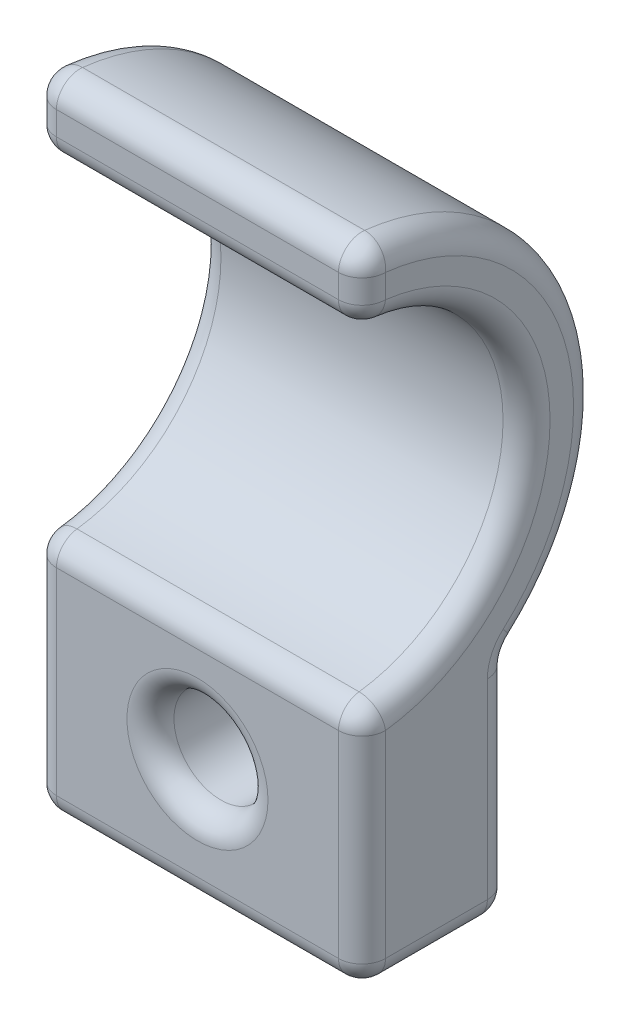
ISO-10303-21;
HEADER;
FILE_DESCRIPTION(('STEP AP214'),'2;1');
FILE_NAME('part.step','',(''),(''),'','','');
FILE_SCHEMA(('AUTOMOTIVE_DESIGN { 1 0 10303 214 1 1 1 1 }'));
ENDSEC;
DATA;
#1=APPLICATION_CONTEXT('core data for automotive mechanical design processes');
#2=APPLICATION_PROTOCOL_DEFINITION('international standard','automotive_design',2000,#1);
#3=PRODUCT_CONTEXT('',#1,'mechanical');
#4=PRODUCT('Part','Part','',(#3));
#5=PRODUCT_RELATED_PRODUCT_CATEGORY('part','',(#4));
#6=PRODUCT_DEFINITION_FORMATION('','',#4);
#7=PRODUCT_DEFINITION_CONTEXT('part definition',#1,'design');
#8=PRODUCT_DEFINITION('design','',#6,#7);
#9=PRODUCT_DEFINITION_SHAPE('','',#8);
#10=(LENGTH_UNIT() NAMED_UNIT(*) SI_UNIT(.MILLI.,.METRE.));
#11=(NAMED_UNIT(*) PLANE_ANGLE_UNIT() SI_UNIT($,.RADIAN.));
#12=(NAMED_UNIT(*) SI_UNIT($,.STERADIAN.) SOLID_ANGLE_UNIT());
#13=UNCERTAINTY_MEASURE_WITH_UNIT(LENGTH_MEASURE(1.E-05),#10,'distance_accuracy_value','');
#14=(GEOMETRIC_REPRESENTATION_CONTEXT(3) GLOBAL_UNCERTAINTY_ASSIGNED_CONTEXT((#13)) GLOBAL_UNIT_ASSIGNED_CONTEXT((#10,
#11,#12)) REPRESENTATION_CONTEXT('',''));
#15=CARTESIAN_POINT('',(0.,0.,0.));
#16=DIRECTION('',(0.,0.,1.));
#17=DIRECTION('',(1.,0.,0.));
#18=AXIS2_PLACEMENT_3D('',#15,#16,#17);
#19=CARTESIAN_POINT('',(-42.,0.,0.));
#20=DIRECTION('',(0.,0.,1.));
#21=DIRECTION('',(1.,0.,0.));
#22=AXIS2_PLACEMENT_3D('',#19,#20,#21);
#23=PLANE('',#22);
#24=DIRECTION('',(0.,-1.,0.));
#25=VECTOR('',#24,1.);
#26=CARTESIAN_POINT('',(-39.,0.,0.));
#27=LINE('',#26,#25);
#28=CARTESIAN_POINT('',(-39.,28.1882382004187,0.));
#29=VERTEX_POINT('',#28);
#30=CARTESIAN_POINT('',(-39.,3.,0.));
#31=VERTEX_POINT('',#30);
#32=EDGE_CURVE('E43',#29,#31,#27,.T.);
#33=ORIENTED_EDGE('',*,*,#32,.T.);
#34=DIRECTION('',(1.,0.,0.));
#35=VECTOR('',#34,1.);
#36=CARTESIAN_POINT('',(-42.,3.,0.));
#37=LINE('',#36,#35);
#38=CARTESIAN_POINT('',(-3.,3.,0.));
#39=VERTEX_POINT('',#38);
#40=EDGE_CURVE('E11',#31,#39,#37,.T.);
#41=ORIENTED_EDGE('',*,*,#40,.T.);
#42=DIRECTION('',(0.,-1.,0.));
#43=VECTOR('',#42,1.);
#44=CARTESIAN_POINT('',(-3.,0.,0.));
#45=LINE('',#44,#43);
#46=CARTESIAN_POINT('',(-3.,28.1882382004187,0.));
#47=VERTEX_POINT('',#46);
#48=EDGE_CURVE('E281',#39,#47,#45,.F.);
#49=ORIENTED_EDGE('',*,*,#48,.T.);
#50=DIRECTION('',(1.,0.,0.));
#51=VECTOR('',#50,1.);
#52=CARTESIAN_POINT('',(-42.,28.1882382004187,0.));
#53=LINE('',#52,#51);
#54=EDGE_CURVE('E54',#47,#29,#53,.F.);
#55=ORIENTED_EDGE('',*,*,#54,.T.);
#56=EDGE_LOOP('',(#33,#41,#49,#55));
#57=FACE_BOUND('',#56,.T.);
#58=CARTESIAN_POINT('',(-21.,16.,0.));
#59=DIRECTION('',(0.,0.,1.));
#60=DIRECTION('',(1.,0.,0.));
#61=AXIS2_PLACEMENT_3D('',#58,#59,#60);
#62=CIRCLE('',#61,9.);
#63=CARTESIAN_POINT('',(-12.,16.,0.));
#64=VERTEX_POINT('',#63);
#65=EDGE_CURVE('E278',#64,#64,#62,.F.);
#66=ORIENTED_EDGE('',*,*,#65,.T.);
#67=EDGE_LOOP('',(#66));
#68=FACE_BOUND('',#67,.T.);
#69=ADVANCED_FACE('F34',(#57,#68),#23,.T.);
#70=CARTESIAN_POINT('',(-42.,52.,0.));
#71=DIRECTION('',(1.,0.,0.));
#72=DIRECTION('',(0.,0.,-1.));
#73=AXIS2_PLACEMENT_3D('',#70,#71,#72);
#74=CYLINDRICAL_SURFACE('',#73,21.);
#75=CARTESIAN_POINT('',(-3.,52.,0.));
#76=DIRECTION('',(1.,0.,0.));
#77=DIRECTION('',(0.,0.,-1.));
#78=AXIS2_PLACEMENT_3D('',#75,#76,#77);
#79=CIRCLE('',#78,21.);
#80=CARTESIAN_POINT('',(-3.,31.1647084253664,-2.625));
#81=VERTEX_POINT('',#80);
#82=CARTESIAN_POINT('',(-3.,72.8352915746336,-2.625));
#83=VERTEX_POINT('',#82);
#84=EDGE_CURVE('E201',#81,#83,#79,.T.);
#85=ORIENTED_EDGE('',*,*,#84,.T.);
#86=DIRECTION('',(1.,0.,0.));
#87=VECTOR('',#86,1.);
#88=CARTESIAN_POINT('',(-42.,72.8352915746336,-2.625));
#89=LINE('',#88,#87);
#90=CARTESIAN_POINT('',(-39.,72.8352915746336,-2.625));
#91=VERTEX_POINT('',#90);
#92=EDGE_CURVE('E171',#83,#91,#89,.F.);
#93=ORIENTED_EDGE('',*,*,#92,.T.);
#94=CARTESIAN_POINT('',(-39.,52.,0.));
#95=DIRECTION('',(1.,0.,0.));
#96=DIRECTION('',(0.,0.,-1.));
#97=AXIS2_PLACEMENT_3D('',#94,#95,#96);
#98=CIRCLE('',#97,21.);
#99=CARTESIAN_POINT('',(-39.,31.1647084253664,-2.625));
#100=VERTEX_POINT('',#99);
#101=EDGE_CURVE('E207',#91,#100,#98,.F.);
#102=ORIENTED_EDGE('',*,*,#101,.T.);
#103=DIRECTION('',(1.,0.,0.));
#104=VECTOR('',#103,1.);
#105=CARTESIAN_POINT('',(-42.,31.1647084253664,-2.625));
#106=LINE('',#105,#104);
#107=EDGE_CURVE('E199',#100,#81,#106,.T.);
#108=ORIENTED_EDGE('',*,*,#107,.T.);
#109=EDGE_LOOP('',(#85,#93,#102,#108));
#110=FACE_BOUND('',#109,.T.);
#111=ADVANCED_FACE('F456',(#110),#74,.F.);
#112=CARTESIAN_POINT('',(-42.,73.,0.));
#113=DIRECTION('',(0.,0.,1.));
#114=DIRECTION('',(1.,0.,0.));
#115=AXIS2_PLACEMENT_3D('',#112,#113,#114);
#116=PLANE('',#115);
#117=DIRECTION('',(0.,-1.,0.));
#118=VECTOR('',#117,1.);
#119=CARTESIAN_POINT('',(-39.,73.,0.));
#120=LINE('',#119,#118);
#121=CARTESIAN_POINT('',(-39.,78.8328157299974,0.));
#122=VERTEX_POINT('',#121);
#123=CARTESIAN_POINT('',(-39.,75.8117617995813,0.));
#124=VERTEX_POINT('',#123);
#125=EDGE_CURVE('E197',#122,#124,#120,.T.);
#126=ORIENTED_EDGE('',*,*,#125,.T.);
#127=DIRECTION('',(1.,0.,0.));
#128=VECTOR('',#127,1.);
#129=CARTESIAN_POINT('',(-42.,75.8117617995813,0.));
#130=LINE('',#129,#128);
#131=CARTESIAN_POINT('',(-3.,75.8117617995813,0.));
#132=VERTEX_POINT('',#131);
#133=EDGE_CURVE('E169',#124,#132,#130,.T.);
#134=ORIENTED_EDGE('',*,*,#133,.T.);
#135=DIRECTION('',(0.,-1.,0.));
#136=VECTOR('',#135,1.);
#137=CARTESIAN_POINT('',(-3.,73.,0.));
#138=LINE('',#137,#136);
#139=CARTESIAN_POINT('',(-3.,78.8328157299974,0.));
#140=VERTEX_POINT('',#139);
#141=EDGE_CURVE('E187',#132,#140,#138,.F.);
#142=ORIENTED_EDGE('',*,*,#141,.T.);
#143=DIRECTION('',(1.,0.,0.));
#144=VECTOR('',#143,1.);
#145=CARTESIAN_POINT('',(-42.,78.8328157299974,0.));
#146=LINE('',#145,#144);
#147=EDGE_CURVE('E193',#140,#122,#146,.F.);
#148=ORIENTED_EDGE('',*,*,#147,.T.);
#149=EDGE_LOOP('',(#126,#134,#142,#148));
#150=FACE_BOUND('',#149,.T.);
#151=ADVANCED_FACE('F195',(#150),#116,.T.);
#152=CARTESIAN_POINT('',(-42.,52.,0.));
#153=DIRECTION('',(1.,0.,0.));
#154=DIRECTION('',(0.,0.,-1.));
#155=AXIS2_PLACEMENT_3D('',#152,#153,#154);
#156=CYLINDRICAL_SURFACE('',#155,30.);
#157=CARTESIAN_POINT('',(-39.,52.,0.));
#158=DIRECTION('',(1.,0.,0.));
#159=DIRECTION('',(0.,0.,-1.));
#160=AXIS2_PLACEMENT_3D('',#157,#158,#159);
#161=CIRCLE('',#160,30.);
#162=CARTESIAN_POINT('',(-39.,29.6393202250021,-20.));
#163=VERTEX_POINT('',#162);
#164=CARTESIAN_POINT('',(-39.,81.8142396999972,-3.33333333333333));
#165=VERTEX_POINT('',#164);
#166=EDGE_CURVE('E239',#163,#165,#161,.T.);
#167=ORIENTED_EDGE('',*,*,#166,.T.);
#168=DIRECTION('',(1.,0.,0.));
#169=VECTOR('',#168,1.);
#170=CARTESIAN_POINT('',(-42.,81.8142396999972,-3.33333333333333));
#171=LINE('',#170,#169);
#172=CARTESIAN_POINT('',(-3.,81.8142396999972,-3.33333333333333));
#173=VERTEX_POINT('',#172);
#174=EDGE_CURVE('E241',#165,#173,#171,.T.);
#175=ORIENTED_EDGE('',*,*,#174,.T.);
#176=CARTESIAN_POINT('',(-3.,52.,0.));
#177=DIRECTION('',(1.,0.,0.));
#178=DIRECTION('',(0.,0.,-1.));
#179=AXIS2_PLACEMENT_3D('',#176,#177,#178);
#180=CIRCLE('',#179,30.);
#181=CARTESIAN_POINT('',(-3.,29.6393202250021,-20.));
#182=VERTEX_POINT('',#181);
#183=EDGE_CURVE('E235',#173,#182,#180,.F.);
#184=ORIENTED_EDGE('',*,*,#183,.T.);
#185=DIRECTION('',(1.,0.,0.));
#186=VECTOR('',#185,1.);
#187=CARTESIAN_POINT('',(-42.,29.6393202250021,-20.));
#188=LINE('',#187,#186);
#189=EDGE_CURVE('E237',#182,#163,#188,.F.);
#190=ORIENTED_EDGE('',*,*,#189,.T.);
#191=EDGE_LOOP('',(#167,#175,#184,#190));
#192=FACE_BOUND('',#191,.T.);
#193=ADVANCED_FACE('F483',(#192),#156,.T.);
#194=CARTESIAN_POINT('',(-42.,0.,-19.));
#195=DIRECTION('',(0.,0.,-1.));
#196=DIRECTION('',(-1.,0.,0.));
#197=AXIS2_PLACEMENT_3D('',#194,#195,#196);
#198=PLANE('',#197);
#199=CARTESIAN_POINT('',(-21.,16.,-19.));
#200=DIRECTION('',(0.,0.,-1.));
#201=DIRECTION('',(-1.,0.,0.));
#202=AXIS2_PLACEMENT_3D('',#199,#200,#201);
#203=CIRCLE('',#202,9.);
#204=CARTESIAN_POINT('',(-30.,16.,-19.));
#205=VERTEX_POINT('',#204);
#206=EDGE_CURVE('E253',#205,#205,#203,.F.);
#207=ORIENTED_EDGE('',*,*,#206,.T.);
#208=EDGE_LOOP('',(#207));
#209=FACE_BOUND('',#208,.T.);
#210=DIRECTION('',(0.,1.,0.));
#211=VECTOR('',#210,1.);
#212=CARTESIAN_POINT('',(-39.,28.7836264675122,-19.));
#213=LINE('',#212,#211);
#214=CARTESIAN_POINT('',(-39.,3.,-19.));
#215=VERTEX_POINT('',#214);
#216=CARTESIAN_POINT('',(-39.,27.4032522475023,-19.));
#217=VERTEX_POINT('',#216);
#218=EDGE_CURVE('E248',#215,#217,#213,.T.);
#219=ORIENTED_EDGE('',*,*,#218,.T.);
#220=DIRECTION('',(-1.,0.,0.));
#221=VECTOR('',#220,1.);
#222=CARTESIAN_POINT('',(0.,27.4032522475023,-19.));
#223=LINE('',#222,#221);
#224=CARTESIAN_POINT('',(-3.,27.4032522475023,-19.));
#225=VERTEX_POINT('',#224);
#226=EDGE_CURVE('E250',#217,#225,#223,.F.);
#227=ORIENTED_EDGE('',*,*,#226,.T.);
#228=DIRECTION('',(0.,1.,0.));
#229=VECTOR('',#228,1.);
#230=CARTESIAN_POINT('',(-3.,0.,-19.));
#231=LINE('',#230,#229);
#232=CARTESIAN_POINT('',(-3.,3.,-19.));
#233=VERTEX_POINT('',#232);
#234=EDGE_CURVE('E244',#225,#233,#231,.F.);
#235=ORIENTED_EDGE('',*,*,#234,.T.);
#236=DIRECTION('',(1.,0.,0.));
#237=VECTOR('',#236,1.);
#238=CARTESIAN_POINT('',(-42.,3.,-19.));
#239=LINE('',#238,#237);
#240=EDGE_CURVE('E246',#233,#215,#239,.F.);
#241=ORIENTED_EDGE('',*,*,#240,.T.);
#242=EDGE_LOOP('',(#219,#227,#235,#241));
#243=FACE_BOUND('',#242,.T.);
#244=ADVANCED_FACE('F417',(#209,#243),#198,.T.);
#245=CARTESIAN_POINT('',(-42.,0.,0.));
#246=DIRECTION('',(0.,-1.,0.));
#247=DIRECTION('',(0.,0.,-1.));
#248=AXIS2_PLACEMENT_3D('',#245,#246,#247);
#249=PLANE('',#248);
#250=DIRECTION('',(1.,0.,0.));
#251=VECTOR('',#250,1.);
#252=CARTESIAN_POINT('',(-42.,0.,-3.));
#253=LINE('',#252,#251);
#254=CARTESIAN_POINT('',(-3.,0.,-3.));
#255=VERTEX_POINT('',#254);
#256=CARTESIAN_POINT('',(-39.,0.,-3.));
#257=VERTEX_POINT('',#256);
#258=EDGE_CURVE('E210',#255,#257,#253,.F.);
#259=ORIENTED_EDGE('',*,*,#258,.T.);
#260=DIRECTION('',(0.,0.,-1.));
#261=VECTOR('',#260,1.);
#262=CARTESIAN_POINT('',(-39.,0.,-19.));
#263=LINE('',#262,#261);
#264=CARTESIAN_POINT('',(-39.,0.,-16.));
#265=VERTEX_POINT('',#264);
#266=EDGE_CURVE('E216',#257,#265,#263,.T.);
#267=ORIENTED_EDGE('',*,*,#266,.T.);
#268=DIRECTION('',(1.,0.,0.));
#269=VECTOR('',#268,1.);
#270=CARTESIAN_POINT('',(-42.,0.,-16.));
#271=LINE('',#270,#269);
#272=CARTESIAN_POINT('',(-3.,0.,-16.));
#273=VERTEX_POINT('',#272);
#274=EDGE_CURVE('E214',#265,#273,#271,.T.);
#275=ORIENTED_EDGE('',*,*,#274,.T.);
#276=DIRECTION('',(0.,0.,-1.));
#277=VECTOR('',#276,1.);
#278=CARTESIAN_POINT('',(-3.,0.,0.));
#279=LINE('',#278,#277);
#280=EDGE_CURVE('E212',#273,#255,#279,.F.);
#281=ORIENTED_EDGE('',*,*,#280,.T.);
#282=EDGE_LOOP('',(#259,#267,#275,#281));
#283=FACE_BOUND('',#282,.T.);
#284=ADVANCED_FACE('F389',(#283),#249,.T.);
#285=CARTESIAN_POINT('',(-42.,52.,0.));
#286=DIRECTION('',(1.,0.,0.));
#287=DIRECTION('',(0.,0.,-1.));
#288=AXIS2_PLACEMENT_3D('',#285,#286,#287);
#289=PLANE('',#288);
#290=DIRECTION('',(0.,-1.,0.));
#291=VECTOR('',#290,1.);
#292=CARTESIAN_POINT('',(-42.,82.,-3.));
#293=LINE('',#292,#291);
#294=CARTESIAN_POINT('',(-42.,75.8117617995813,-3.));
#295=VERTEX_POINT('',#294);
#296=CARTESIAN_POINT('',(-42.,78.8328157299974,-3.));
#297=VERTEX_POINT('',#296);
#298=EDGE_CURVE('E223',#295,#297,#293,.F.);
#299=ORIENTED_EDGE('',*,*,#298,.T.);
#300=CARTESIAN_POINT('',(-42.,52.,0.));
#301=DIRECTION('',(1.,0.,0.));
#302=DIRECTION('',(0.,0.,-1.));
#303=AXIS2_PLACEMENT_3D('',#300,#301,#302);
#304=CIRCLE('',#303,27.);
#305=CARTESIAN_POINT('',(-42.,31.8753882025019,-18.));
#306=VERTEX_POINT('',#305);
#307=EDGE_CURVE('E233',#297,#306,#304,.F.);
#308=ORIENTED_EDGE('',*,*,#307,.T.);
#309=CARTESIAN_POINT('',(-42.,27.4032522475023,-22.));
#310=DIRECTION('',(1.,0.,0.));
#311=DIRECTION('',(0.,0.,-1.));
#312=AXIS2_PLACEMENT_3D('',#309,#310,#311);
#313=CIRCLE('',#312,6.);
#314=CARTESIAN_POINT('',(-42.,27.4032522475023,-16.));
#315=VERTEX_POINT('',#314);
#316=EDGE_CURVE('E230',#315,#306,#313,.F.);
#317=ORIENTED_EDGE('',*,*,#316,.F.);
#318=DIRECTION('',(0.,1.,0.));
#319=VECTOR('',#318,1.);
#320=CARTESIAN_POINT('',(-42.,0.,-16.));
#321=LINE('',#320,#319);
#322=CARTESIAN_POINT('',(-42.,3.,-16.));
#323=VERTEX_POINT('',#322);
#324=EDGE_CURVE('E228',#315,#323,#321,.F.);
#325=ORIENTED_EDGE('',*,*,#324,.T.);
#326=DIRECTION('',(0.,0.,-1.));
#327=VECTOR('',#326,1.);
#328=CARTESIAN_POINT('',(-42.,3.,0.));
#329=LINE('',#328,#327);
#330=CARTESIAN_POINT('',(-42.,3.,-3.));
#331=VERTEX_POINT('',#330);
#332=EDGE_CURVE('E225',#323,#331,#329,.F.);
#333=ORIENTED_EDGE('',*,*,#332,.T.);
#334=DIRECTION('',(0.,-1.,0.));
#335=VECTOR('',#334,1.);
#336=CARTESIAN_POINT('',(-42.,31.,-3.));
#337=LINE('',#336,#335);
#338=CARTESIAN_POINT('',(-42.,28.1882382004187,-3.));
#339=VERTEX_POINT('',#338);
#340=EDGE_CURVE('E219',#331,#339,#337,.F.);
#341=ORIENTED_EDGE('',*,*,#340,.T.);
#342=CARTESIAN_POINT('',(-42.,52.,0.));
#343=DIRECTION('',(1.,0.,0.));
#344=DIRECTION('',(0.,0.,-1.));
#345=AXIS2_PLACEMENT_3D('',#342,#343,#344);
#346=CIRCLE('',#345,24.);
#347=EDGE_CURVE('E221',#339,#295,#346,.T.);
#348=ORIENTED_EDGE('',*,*,#347,.T.);
#349=EDGE_LOOP('',(#299,#308,#317,#325,#333,#341,#348));
#350=FACE_BOUND('',#349,.T.);
#351=ADVANCED_FACE('F408',(#350),#289,.F.);
#352=CARTESIAN_POINT('',(0.,52.,0.));
#353=DIRECTION('',(1.,0.,0.));
#354=DIRECTION('',(0.,0.,-1.));
#355=AXIS2_PLACEMENT_3D('',#352,#353,#354);
#356=PLANE('',#355);
#357=CARTESIAN_POINT('',(0.,52.,0.));
#358=DIRECTION('',(1.,0.,0.));
#359=DIRECTION('',(0.,0.,-1.));
#360=AXIS2_PLACEMENT_3D('',#357,#358,#359);
#361=CIRCLE('',#360,27.);
#362=CARTESIAN_POINT('',(0.,31.8753882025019,-18.));
#363=VERTEX_POINT('',#362);
#364=CARTESIAN_POINT('',(0.,78.8328157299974,-3.));
#365=VERTEX_POINT('',#364);
#366=EDGE_CURVE('E274',#363,#365,#361,.T.);
#367=ORIENTED_EDGE('',*,*,#366,.T.);
#368=DIRECTION('',(0.,-1.,0.));
#369=VECTOR('',#368,1.);
#370=CARTESIAN_POINT('',(0.,52.,-3.));
#371=LINE('',#370,#369);
#372=CARTESIAN_POINT('',(0.,75.8117617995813,-3.));
#373=VERTEX_POINT('',#372);
#374=EDGE_CURVE('E276',#365,#373,#371,.T.);
#375=ORIENTED_EDGE('',*,*,#374,.T.);
#376=CARTESIAN_POINT('',(0.,52.,0.));
#377=DIRECTION('',(1.,0.,0.));
#378=DIRECTION('',(0.,0.,-1.));
#379=AXIS2_PLACEMENT_3D('',#376,#377,#378);
#380=CIRCLE('',#379,24.);
#381=CARTESIAN_POINT('',(0.,28.1882382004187,-3.));
#382=VERTEX_POINT('',#381);
#383=EDGE_CURVE('E268',#373,#382,#380,.F.);
#384=ORIENTED_EDGE('',*,*,#383,.T.);
#385=DIRECTION('',(0.,-1.,0.));
#386=VECTOR('',#385,1.);
#387=CARTESIAN_POINT('',(0.,52.,-3.));
#388=LINE('',#387,#386);
#389=CARTESIAN_POINT('',(0.,3.,-3.));
#390=VERTEX_POINT('',#389);
#391=EDGE_CURVE('E262',#382,#390,#388,.T.);
#392=ORIENTED_EDGE('',*,*,#391,.T.);
#393=DIRECTION('',(0.,0.,-1.));
#394=VECTOR('',#393,1.);
#395=CARTESIAN_POINT('',(0.,3.,0.));
#396=LINE('',#395,#394);
#397=CARTESIAN_POINT('',(0.,3.,-16.));
#398=VERTEX_POINT('',#397);
#399=EDGE_CURVE('E264',#390,#398,#396,.T.);
#400=ORIENTED_EDGE('',*,*,#399,.T.);
#401=DIRECTION('',(0.,1.,0.));
#402=VECTOR('',#401,1.);
#403=CARTESIAN_POINT('',(0.,52.,-16.));
#404=LINE('',#403,#402);
#405=CARTESIAN_POINT('',(0.,27.4032522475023,-16.));
#406=VERTEX_POINT('',#405);
#407=EDGE_CURVE('E266',#398,#406,#404,.T.);
#408=ORIENTED_EDGE('',*,*,#407,.T.);
#409=CARTESIAN_POINT('',(0.,27.4032522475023,-22.));
#410=DIRECTION('',(1.,0.,0.));
#411=DIRECTION('',(0.,0.,-1.));
#412=AXIS2_PLACEMENT_3D('',#409,#410,#411);
#413=CIRCLE('',#412,6.);
#414=EDGE_CURVE('E271',#363,#406,#413,.T.);
#415=ORIENTED_EDGE('',*,*,#414,.F.);
#416=EDGE_LOOP('',(#367,#375,#384,#392,#400,#408,#415));
#417=FACE_BOUND('',#416,.T.);
#418=ADVANCED_FACE('F490',(#417),#356,.T.);
#419=CARTESIAN_POINT('',(-21.,16.,-30.));
#420=DIRECTION('',(0.,0.,1.));
#421=DIRECTION('',(1.,0.,0.));
#422=AXIS2_PLACEMENT_3D('',#419,#420,#421);
#423=CYLINDRICAL_SURFACE('',#422,6.);
#424=CARTESIAN_POINT('',(-21.,16.,-16.));
#425=DIRECTION('',(0.,0.,-1.));
#426=DIRECTION('',(-1.,0.,0.));
#427=AXIS2_PLACEMENT_3D('',#424,#425,#426);
#428=CIRCLE('',#427,6.);
#429=CARTESIAN_POINT('',(-27.,16.,-16.));
#430=VERTEX_POINT('',#429);
#431=EDGE_CURVE('E259',#430,#430,#428,.T.);
#432=ORIENTED_EDGE('',*,*,#431,.T.);
#433=EDGE_LOOP('',(#432));
#434=FACE_BOUND('',#433,.T.);
#435=CARTESIAN_POINT('',(-21.,16.,-3.));
#436=DIRECTION('',(0.,0.,1.));
#437=DIRECTION('',(1.,0.,0.));
#438=AXIS2_PLACEMENT_3D('',#435,#436,#437);
#439=CIRCLE('',#438,6.);
#440=CARTESIAN_POINT('',(-15.,16.,-3.));
#441=VERTEX_POINT('',#440);
#442=EDGE_CURVE('E256',#441,#441,#439,.T.);
#443=ORIENTED_EDGE('',*,*,#442,.T.);
#444=EDGE_LOOP('',(#443));
#445=FACE_BOUND('',#444,.T.);
#446=ADVANCED_FACE('F492',(#434,#445),#423,.F.);
#447=CARTESIAN_POINT('',(-42.,3.,-16.));
#448=DIRECTION('',(1.,0.,0.));
#449=DIRECTION('',(0.,0.,-1.));
#450=AXIS2_PLACEMENT_3D('',#447,#448,#449);
#451=CYLINDRICAL_SURFACE('',#450,3.);
#452=CARTESIAN_POINT('',(-39.,3.,-16.));
#453=DIRECTION('',(-1.,0.,0.));
#454=DIRECTION('',(0.,0.,1.));
#455=AXIS2_PLACEMENT_3D('',#452,#453,#454);
#456=CIRCLE('',#455,3.);
#457=EDGE_CURVE('E38',#215,#265,#456,.T.);
#458=ORIENTED_EDGE('',*,*,#457,.F.);
#459=ORIENTED_EDGE('',*,*,#240,.F.);
#460=CARTESIAN_POINT('',(-3.,3.,-16.));
#461=DIRECTION('',(1.,0.,0.));
#462=DIRECTION('',(0.,0.,-1.));
#463=AXIS2_PLACEMENT_3D('',#460,#461,#462);
#464=CIRCLE('',#463,3.);
#465=EDGE_CURVE('E369',#273,#233,#464,.T.);
#466=ORIENTED_EDGE('',*,*,#465,.F.);
#467=ORIENTED_EDGE('',*,*,#274,.F.);
#468=EDGE_LOOP('',(#458,#459,#466,#467));
#469=FACE_BOUND('',#468,.T.);
#470=ADVANCED_FACE('F386',(#469),#451,.T.);
#471=CARTESIAN_POINT('',(-39.,3.,-16.));
#472=DIRECTION('',(0.,0.,1.));
#473=DIRECTION('',(1.,0.,0.));
#474=AXIS2_PLACEMENT_3D('',#471,#472,#473);
#475=SPHERICAL_SURFACE('',#474,3.);
#476=CARTESIAN_POINT('',(-39.,3.,-16.));
#477=DIRECTION('',(0.,-1.,0.));
#478=DIRECTION('',(0.,0.,-1.));
#479=AXIS2_PLACEMENT_3D('',#476,#477,#478);
#480=CIRCLE('',#479,3.);
#481=EDGE_CURVE('E365',#215,#323,#480,.F.);
#482=ORIENTED_EDGE('',*,*,#481,.F.);
#483=ORIENTED_EDGE('',*,*,#457,.T.);
#484=CARTESIAN_POINT('',(-39.,3.,-16.));
#485=DIRECTION('',(0.,0.,-1.));
#486=DIRECTION('',(-1.,0.,0.));
#487=AXIS2_PLACEMENT_3D('',#484,#485,#486);
#488=CIRCLE('',#487,3.);
#489=EDGE_CURVE('E368',#323,#265,#488,.F.);
#490=ORIENTED_EDGE('',*,*,#489,.F.);
#491=EDGE_LOOP('',(#482,#483,#490));
#492=FACE_BOUND('',#491,.T.);
#493=ADVANCED_FACE('F381',(#492),#475,.T.);
#494=CARTESIAN_POINT('',(-3.,3.,-16.));
#495=DIRECTION('',(0.,0.,1.));
#496=DIRECTION('',(1.,0.,0.));
#497=AXIS2_PLACEMENT_3D('',#494,#495,#496);
#498=SPHERICAL_SURFACE('',#497,3.);
#499=CARTESIAN_POINT('',(-3.,3.,-16.));
#500=DIRECTION('',(0.,0.,-1.));
#501=DIRECTION('',(-1.,0.,0.));
#502=AXIS2_PLACEMENT_3D('',#499,#500,#501);
#503=CIRCLE('',#502,3.);
#504=EDGE_CURVE('E359',#273,#398,#503,.F.);
#505=ORIENTED_EDGE('',*,*,#504,.F.);
#506=ORIENTED_EDGE('',*,*,#465,.T.);
#507=CARTESIAN_POINT('',(-3.,3.,-16.));
#508=DIRECTION('',(0.,-1.,0.));
#509=DIRECTION('',(1.,0.,0.));
#510=AXIS2_PLACEMENT_3D('',#507,#508,#509);
#511=CIRCLE('',#510,3.);
#512=EDGE_CURVE('E362',#398,#233,#511,.F.);
#513=ORIENTED_EDGE('',*,*,#512,.F.);
#514=EDGE_LOOP('',(#505,#506,#513));
#515=FACE_BOUND('',#514,.T.);
#516=ADVANCED_FACE('F431',(#515),#498,.T.);
#517=CARTESIAN_POINT('',(-39.,3.,0.));
#518=DIRECTION('',(0.,0.,1.));
#519=DIRECTION('',(1.,0.,0.));
#520=AXIS2_PLACEMENT_3D('',#517,#518,#519);
#521=CYLINDRICAL_SURFACE('',#520,3.);
#522=ORIENTED_EDGE('',*,*,#489,.T.);
#523=ORIENTED_EDGE('',*,*,#266,.F.);
#524=CARTESIAN_POINT('',(-39.,3.,-3.));
#525=DIRECTION('',(0.,0.,1.));
#526=DIRECTION('',(1.,0.,0.));
#527=AXIS2_PLACEMENT_3D('',#524,#525,#526);
#528=CIRCLE('',#527,3.);
#529=EDGE_CURVE('E353',#331,#257,#528,.T.);
#530=ORIENTED_EDGE('',*,*,#529,.F.);
#531=ORIENTED_EDGE('',*,*,#332,.F.);
#532=EDGE_LOOP('',(#522,#523,#530,#531));
#533=FACE_BOUND('',#532,.T.);
#534=ADVANCED_FACE('F394',(#533),#521,.T.);
#535=CARTESIAN_POINT('',(-39.,0.,-16.));
#536=DIRECTION('',(0.,-1.,0.));
#537=DIRECTION('',(0.,0.,-1.));
#538=AXIS2_PLACEMENT_3D('',#535,#536,#537);
#539=CYLINDRICAL_SURFACE('',#538,3.);
#540=ORIENTED_EDGE('',*,*,#481,.T.);
#541=ORIENTED_EDGE('',*,*,#324,.F.);
#542=CARTESIAN_POINT('',(-39.,27.4032522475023,-16.));
#543=DIRECTION('',(0.,1.,0.));
#544=DIRECTION('',(0.,0.,1.));
#545=AXIS2_PLACEMENT_3D('',#542,#543,#544);
#546=CIRCLE('',#545,3.);
#547=EDGE_CURVE('E350',#217,#315,#546,.T.);
#548=ORIENTED_EDGE('',*,*,#547,.F.);
#549=ORIENTED_EDGE('',*,*,#218,.F.);
#550=EDGE_LOOP('',(#540,#541,#548,#549));
#551=FACE_BOUND('',#550,.T.);
#552=ADVANCED_FACE('F414',(#551),#539,.T.);
#553=CARTESIAN_POINT('',(-42.,27.4032522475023,-22.));
#554=DIRECTION('',(1.,0.,0.));
#555=DIRECTION('',(0.,0.,-1.));
#556=AXIS2_PLACEMENT_3D('',#553,#554,#555);
#557=CYLINDRICAL_SURFACE('',#556,3.);
#558=CARTESIAN_POINT('',(-3.00000000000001,27.4032522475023,-22.));
#559=DIRECTION('',(1.,0.,0.));
#560=DIRECTION('',(0.,0.,-1.));
#561=AXIS2_PLACEMENT_3D('',#558,#559,#560);
#562=CIRCLE('',#561,3.);
#563=EDGE_CURVE('E344',#225,#182,#562,.F.);
#564=ORIENTED_EDGE('',*,*,#563,.F.);
#565=ORIENTED_EDGE('',*,*,#226,.F.);
#566=CARTESIAN_POINT('',(-39.,27.4032522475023,-22.));
#567=DIRECTION('',(1.,0.,0.));
#568=DIRECTION('',(0.,0.,-1.));
#569=AXIS2_PLACEMENT_3D('',#566,#567,#568);
#570=CIRCLE('',#569,3.);
#571=EDGE_CURVE('E347',#163,#217,#570,.T.);
#572=ORIENTED_EDGE('',*,*,#571,.F.);
#573=ORIENTED_EDGE('',*,*,#189,.F.);
#574=EDGE_LOOP('',(#564,#565,#572,#573));
#575=FACE_BOUND('',#574,.T.);
#576=ADVANCED_FACE('F421',(#575),#557,.F.);
#577=CARTESIAN_POINT('',(-3.,52.,-16.));
#578=DIRECTION('',(0.,1.,0.));
#579=DIRECTION('',(0.,0.,1.));
#580=AXIS2_PLACEMENT_3D('',#577,#578,#579);
#581=CYLINDRICAL_SURFACE('',#580,3.);
#582=ORIENTED_EDGE('',*,*,#512,.T.);
#583=ORIENTED_EDGE('',*,*,#234,.F.);
#584=CARTESIAN_POINT('',(-3.,27.4032522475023,-16.));
#585=DIRECTION('',(0.,1.,0.));
#586=DIRECTION('',(0.,0.,1.));
#587=AXIS2_PLACEMENT_3D('',#584,#585,#586);
#588=CIRCLE('',#587,3.);
#589=EDGE_CURVE('E342',#406,#225,#588,.T.);
#590=ORIENTED_EDGE('',*,*,#589,.F.);
#591=ORIENTED_EDGE('',*,*,#407,.F.);
#592=EDGE_LOOP('',(#582,#583,#590,#591));
#593=FACE_BOUND('',#592,.T.);
#594=ADVANCED_FACE('F429',(#593),#581,.T.);
#595=CARTESIAN_POINT('',(-3.,3.,0.));
#596=DIRECTION('',(0.,0.,-1.));
#597=DIRECTION('',(-1.,0.,0.));
#598=AXIS2_PLACEMENT_3D('',#595,#596,#597);
#599=CYLINDRICAL_SURFACE('',#598,3.);
#600=ORIENTED_EDGE('',*,*,#504,.T.);
#601=ORIENTED_EDGE('',*,*,#399,.F.);
#602=CARTESIAN_POINT('',(-3.,3.,-3.));
#603=DIRECTION('',(0.,0.,1.));
#604=DIRECTION('',(1.,0.,0.));
#605=AXIS2_PLACEMENT_3D('',#602,#603,#604);
#606=CIRCLE('',#605,3.);
#607=EDGE_CURVE('E339',#255,#390,#606,.T.);
#608=ORIENTED_EDGE('',*,*,#607,.F.);
#609=ORIENTED_EDGE('',*,*,#280,.F.);
#610=EDGE_LOOP('',(#600,#601,#608,#609));
#611=FACE_BOUND('',#610,.T.);
#612=ADVANCED_FACE('F435',(#611),#599,.T.);
#613=CARTESIAN_POINT('',(-42.,3.,-3.));
#614=DIRECTION('',(1.,0.,0.));
#615=DIRECTION('',(0.,0.,-1.));
#616=AXIS2_PLACEMENT_3D('',#613,#614,#615);
#617=CYLINDRICAL_SURFACE('',#616,3.);
#618=CARTESIAN_POINT('',(-39.,3.,-3.));
#619=DIRECTION('',(-1.,0.,0.));
#620=DIRECTION('',(0.,0.,1.));
#621=AXIS2_PLACEMENT_3D('',#618,#619,#620);
#622=CIRCLE('',#621,3.);
#623=EDGE_CURVE('E356',#257,#31,#622,.T.);
#624=ORIENTED_EDGE('',*,*,#623,.F.);
#625=ORIENTED_EDGE('',*,*,#258,.F.);
#626=CARTESIAN_POINT('',(-3.,3.,-3.));
#627=DIRECTION('',(1.,0.,0.));
#628=DIRECTION('',(0.,0.,-1.));
#629=AXIS2_PLACEMENT_3D('',#626,#627,#628);
#630=CIRCLE('',#629,3.);
#631=EDGE_CURVE('E336',#39,#255,#630,.T.);
#632=ORIENTED_EDGE('',*,*,#631,.F.);
#633=ORIENTED_EDGE('',*,*,#40,.F.);
#634=EDGE_LOOP('',(#624,#625,#632,#633));
#635=FACE_BOUND('',#634,.T.);
#636=ADVANCED_FACE('F396',(#635),#617,.T.);
#637=CARTESIAN_POINT('',(-39.,3.,-3.));
#638=DIRECTION('',(0.,0.,1.));
#639=DIRECTION('',(1.,0.,0.));
#640=AXIS2_PLACEMENT_3D('',#637,#638,#639);
#641=SPHERICAL_SURFACE('',#640,3.);
#642=ORIENTED_EDGE('',*,*,#529,.T.);
#643=ORIENTED_EDGE('',*,*,#623,.T.);
#644=CARTESIAN_POINT('',(-39.,3.,-3.));
#645=DIRECTION('',(0.,-1.,0.));
#646=DIRECTION('',(0.,0.,-1.));
#647=AXIS2_PLACEMENT_3D('',#644,#645,#646);
#648=CIRCLE('',#647,3.);
#649=EDGE_CURVE('E333',#331,#31,#648,.F.);
#650=ORIENTED_EDGE('',*,*,#649,.F.);
#651=EDGE_LOOP('',(#642,#643,#650));
#652=FACE_BOUND('',#651,.T.);
#653=ADVANCED_FACE('F401',(#652),#641,.T.);
#654=CARTESIAN_POINT('',(-39.,27.4032522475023,-22.));
#655=DIRECTION('',(1.,0.,0.));
#656=DIRECTION('',(0.,0.,-1.));
#657=AXIS2_PLACEMENT_3D('',#654,#655,#656);
#658=TOROIDAL_SURFACE('',#657,6.,3.);
#659=ORIENTED_EDGE('',*,*,#547,.T.);
#660=ORIENTED_EDGE('',*,*,#316,.T.);
#661=CARTESIAN_POINT('',(-39.,31.8753882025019,-18.));
#662=DIRECTION('',(0.,-0.666666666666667,0.745355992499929));
#663=DIRECTION('',(0.,-0.745355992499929,-0.666666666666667));
#664=AXIS2_PLACEMENT_3D('',#661,#662,#663);
#665=CIRCLE('',#664,3.);
#666=EDGE_CURVE('E330',#163,#306,#665,.F.);
#667=ORIENTED_EDGE('',*,*,#666,.F.);
#668=ORIENTED_EDGE('',*,*,#571,.T.);
#669=EDGE_LOOP('',(#659,#660,#667,#668));
#670=FACE_BOUND('',#669,.T.);
#671=ADVANCED_FACE('F551',(#670),#658,.T.);
#672=CARTESIAN_POINT('',(-3.,27.4032522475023,-22.));
#673=DIRECTION('',(1.,0.,0.));
#674=DIRECTION('',(0.,0.,-1.));
#675=AXIS2_PLACEMENT_3D('',#672,#673,#674);
#676=TOROIDAL_SURFACE('',#675,6.,3.);
#677=ORIENTED_EDGE('',*,*,#589,.T.);
#678=ORIENTED_EDGE('',*,*,#563,.T.);
#679=CARTESIAN_POINT('',(-3.,31.8753882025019,-18.));
#680=DIRECTION('',(0.,-0.666666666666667,0.745355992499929));
#681=DIRECTION('',(0.,-0.745355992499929,-0.666666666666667));
#682=AXIS2_PLACEMENT_3D('',#679,#680,#681);
#683=CIRCLE('',#682,3.);
#684=EDGE_CURVE('E327',#363,#182,#683,.F.);
#685=ORIENTED_EDGE('',*,*,#684,.F.);
#686=ORIENTED_EDGE('',*,*,#414,.T.);
#687=EDGE_LOOP('',(#677,#678,#685,#686));
#688=FACE_BOUND('',#687,.T.);
#689=ADVANCED_FACE('F488',(#688),#676,.T.);
#690=CARTESIAN_POINT('',(-3.,3.,-3.));
#691=DIRECTION('',(0.,0.,1.));
#692=DIRECTION('',(1.,0.,0.));
#693=AXIS2_PLACEMENT_3D('',#690,#691,#692);
#694=SPHERICAL_SURFACE('',#693,3.);
#695=ORIENTED_EDGE('',*,*,#631,.T.);
#696=ORIENTED_EDGE('',*,*,#607,.T.);
#697=CARTESIAN_POINT('',(-3.,3.,-3.));
#698=DIRECTION('',(0.,-1.,0.));
#699=DIRECTION('',(0.,0.,-1.));
#700=AXIS2_PLACEMENT_3D('',#697,#698,#699);
#701=CIRCLE('',#700,3.);
#702=EDGE_CURVE('E324',#39,#390,#701,.F.);
#703=ORIENTED_EDGE('',*,*,#702,.F.);
#704=EDGE_LOOP('',(#695,#696,#703));
#705=FACE_BOUND('',#704,.T.);
#706=ADVANCED_FACE('F438',(#705),#694,.T.);
#707=CARTESIAN_POINT('',(-39.,0.,-3.));
#708=DIRECTION('',(0.,1.,0.));
#709=DIRECTION('',(0.,0.,1.));
#710=AXIS2_PLACEMENT_3D('',#707,#708,#709);
#711=CYLINDRICAL_SURFACE('',#710,3.);
#712=ORIENTED_EDGE('',*,*,#649,.T.);
#713=ORIENTED_EDGE('',*,*,#32,.F.);
#714=CARTESIAN_POINT('',(-39.,28.1882382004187,-3.));
#715=DIRECTION('',(0.,1.,0.));
#716=DIRECTION('',(0.,0.,1.));
#717=AXIS2_PLACEMENT_3D('',#714,#715,#716);
#718=CIRCLE('',#717,3.);
#719=EDGE_CURVE('E318',#339,#29,#718,.T.);
#720=ORIENTED_EDGE('',*,*,#719,.F.);
#721=ORIENTED_EDGE('',*,*,#340,.F.);
#722=EDGE_LOOP('',(#712,#713,#720,#721));
#723=FACE_BOUND('',#722,.T.);
#724=ADVANCED_FACE('F403',(#723),#711,.T.);
#725=CARTESIAN_POINT('',(-39.,52.,0.));
#726=DIRECTION('',(1.,0.,0.));
#727=DIRECTION('',(0.,0.,-1.));
#728=AXIS2_PLACEMENT_3D('',#725,#726,#727);
#729=TOROIDAL_SURFACE('',#728,27.,3.);
#730=ORIENTED_EDGE('',*,*,#666,.T.);
#731=ORIENTED_EDGE('',*,*,#307,.F.);
#732=CARTESIAN_POINT('',(-39.,78.8328157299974,-3.));
#733=DIRECTION('',(0.,0.111111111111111,0.993807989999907));
#734=DIRECTION('',(0.,-0.993807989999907,0.111111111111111));
#735=AXIS2_PLACEMENT_3D('',#732,#733,#734);
#736=CIRCLE('',#735,3.);
#737=EDGE_CURVE('E315',#165,#297,#736,.T.);
#738=ORIENTED_EDGE('',*,*,#737,.F.);
#739=ORIENTED_EDGE('',*,*,#166,.F.);
#740=EDGE_LOOP('',(#730,#731,#738,#739));
#741=FACE_BOUND('',#740,.T.);
#742=ADVANCED_FACE('F472',(#741),#729,.T.);
#743=CARTESIAN_POINT('',(-42.,78.8328157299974,-3.));
#744=DIRECTION('',(1.,0.,0.));
#745=DIRECTION('',(0.,0.,-1.));
#746=AXIS2_PLACEMENT_3D('',#743,#744,#745);
#747=CYLINDRICAL_SURFACE('',#746,3.);
#748=CARTESIAN_POINT('',(-3.,78.8328157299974,-3.));
#749=DIRECTION('',(1.,0.,0.));
#750=DIRECTION('',(0.,0.,-1.));
#751=AXIS2_PLACEMENT_3D('',#748,#749,#750);
#752=CIRCLE('',#751,3.);
#753=EDGE_CURVE('E309',#173,#140,#752,.T.);
#754=ORIENTED_EDGE('',*,*,#753,.F.);
#755=ORIENTED_EDGE('',*,*,#174,.F.);
#756=CARTESIAN_POINT('',(-39.,78.8328157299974,-3.));
#757=DIRECTION('',(-1.,0.,0.));
#758=DIRECTION('',(0.,0.,1.));
#759=AXIS2_PLACEMENT_3D('',#756,#757,#758);
#760=CIRCLE('',#759,3.);
#761=EDGE_CURVE('E312',#122,#165,#760,.T.);
#762=ORIENTED_EDGE('',*,*,#761,.F.);
#763=ORIENTED_EDGE('',*,*,#147,.F.);
#764=EDGE_LOOP('',(#754,#755,#762,#763));
#765=FACE_BOUND('',#764,.T.);
#766=ADVANCED_FACE('F480',(#765),#747,.T.);
#767=CARTESIAN_POINT('',(-3.,52.,0.));
#768=DIRECTION('',(1.,0.,0.));
#769=DIRECTION('',(0.,0.,-1.));
#770=AXIS2_PLACEMENT_3D('',#767,#768,#769);
#771=TOROIDAL_SURFACE('',#770,27.,3.);
#772=ORIENTED_EDGE('',*,*,#684,.T.);
#773=ORIENTED_EDGE('',*,*,#183,.F.);
#774=CARTESIAN_POINT('',(-3.,78.8328157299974,-3.));
#775=DIRECTION('',(0.,0.111111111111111,0.993807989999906));
#776=DIRECTION('',(0.,-0.993807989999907,0.111111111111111));
#777=AXIS2_PLACEMENT_3D('',#774,#775,#776);
#778=CIRCLE('',#777,3.);
#779=EDGE_CURVE('E307',#365,#173,#778,.T.);
#780=ORIENTED_EDGE('',*,*,#779,.F.);
#781=ORIENTED_EDGE('',*,*,#366,.F.);
#782=EDGE_LOOP('',(#772,#773,#780,#781));
#783=FACE_BOUND('',#782,.T.);
#784=ADVANCED_FACE('F486',(#783),#771,.T.);
#785=CARTESIAN_POINT('',(-3.,52.,-3.));
#786=DIRECTION('',(0.,-1.,0.));
#787=DIRECTION('',(0.,0.,-1.));
#788=AXIS2_PLACEMENT_3D('',#785,#786,#787);
#789=CYLINDRICAL_SURFACE('',#788,3.);
#790=ORIENTED_EDGE('',*,*,#702,.T.);
#791=ORIENTED_EDGE('',*,*,#391,.F.);
#792=CARTESIAN_POINT('',(-3.,28.1882382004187,-3.));
#793=DIRECTION('',(0.,1.,0.));
#794=DIRECTION('',(-1.,0.,0.));
#795=AXIS2_PLACEMENT_3D('',#792,#793,#794);
#796=CIRCLE('',#795,3.);
#797=EDGE_CURVE('E304',#47,#382,#796,.T.);
#798=ORIENTED_EDGE('',*,*,#797,.F.);
#799=ORIENTED_EDGE('',*,*,#48,.F.);
#800=EDGE_LOOP('',(#790,#791,#798,#799));
#801=FACE_BOUND('',#800,.T.);
#802=ADVANCED_FACE('F448',(#801),#789,.T.);
#803=CARTESIAN_POINT('',(-42.,28.1882382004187,-3.));
#804=DIRECTION('',(1.,0.,0.));
#805=DIRECTION('',(0.,0.,-1.));
#806=AXIS2_PLACEMENT_3D('',#803,#804,#805);
#807=CYLINDRICAL_SURFACE('',#806,3.);
#808=CARTESIAN_POINT('',(-39.,28.1882382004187,-3.));
#809=DIRECTION('',(-1.,0.,0.));
#810=DIRECTION('',(0.,0.,1.));
#811=AXIS2_PLACEMENT_3D('',#808,#809,#810);
#812=CIRCLE('',#811,3.);
#813=EDGE_CURVE('E321',#29,#100,#812,.T.);
#814=ORIENTED_EDGE('',*,*,#813,.F.);
#815=ORIENTED_EDGE('',*,*,#54,.F.);
#816=CARTESIAN_POINT('',(-3.,28.1882382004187,-3.));
#817=DIRECTION('',(1.,0.,0.));
#818=DIRECTION('',(0.,1.,0.));
#819=AXIS2_PLACEMENT_3D('',#816,#817,#818);
#820=CIRCLE('',#819,3.);
#821=EDGE_CURVE('E301',#81,#47,#820,.T.);
#822=ORIENTED_EDGE('',*,*,#821,.F.);
#823=ORIENTED_EDGE('',*,*,#107,.F.);
#824=EDGE_LOOP('',(#814,#815,#822,#823));
#825=FACE_BOUND('',#824,.T.);
#826=ADVANCED_FACE('F444',(#825),#807,.T.);
#827=CARTESIAN_POINT('',(-39.,28.1882382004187,-3.));
#828=DIRECTION('',(0.,0.,1.));
#829=DIRECTION('',(1.,0.,0.));
#830=AXIS2_PLACEMENT_3D('',#827,#828,#829);
#831=SPHERICAL_SURFACE('',#830,3.);
#832=ORIENTED_EDGE('',*,*,#719,.T.);
#833=ORIENTED_EDGE('',*,*,#813,.T.);
#834=CARTESIAN_POINT('',(-39.,28.1882382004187,-3.));
#835=DIRECTION('',(0.,-0.125,0.992156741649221));
#836=DIRECTION('',(0.,-0.992156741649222,-0.125));
#837=AXIS2_PLACEMENT_3D('',#834,#835,#836);
#838=CIRCLE('',#837,3.);
#839=EDGE_CURVE('E298',#339,#100,#838,.F.);
#840=ORIENTED_EDGE('',*,*,#839,.F.);
#841=EDGE_LOOP('',(#832,#833,#840));
#842=FACE_BOUND('',#841,.T.);
#843=ADVANCED_FACE('F459',(#842),#831,.T.);
#844=CARTESIAN_POINT('',(-39.,78.8328157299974,-3.));
#845=DIRECTION('',(0.,0.,1.));
#846=DIRECTION('',(1.,0.,0.));
#847=AXIS2_PLACEMENT_3D('',#844,#845,#846);
#848=SPHERICAL_SURFACE('',#847,3.);
#849=ORIENTED_EDGE('',*,*,#761,.T.);
#850=ORIENTED_EDGE('',*,*,#737,.T.);
#851=CARTESIAN_POINT('',(-39.,78.8328157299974,-3.));
#852=DIRECTION('',(0.,1.,0.));
#853=DIRECTION('',(0.,0.,1.));
#854=AXIS2_PLACEMENT_3D('',#851,#852,#853);
#855=CIRCLE('',#854,3.);
#856=EDGE_CURVE('E295',#122,#297,#855,.F.);
#857=ORIENTED_EDGE('',*,*,#856,.F.);
#858=EDGE_LOOP('',(#849,#850,#857));
#859=FACE_BOUND('',#858,.T.);
#860=ADVANCED_FACE('F475',(#859),#848,.T.);
#861=CARTESIAN_POINT('',(-3.,78.8328157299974,-3.));
#862=DIRECTION('',(0.,0.,1.));
#863=DIRECTION('',(1.,0.,0.));
#864=AXIS2_PLACEMENT_3D('',#861,#862,#863);
#865=SPHERICAL_SURFACE('',#864,3.);
#866=ORIENTED_EDGE('',*,*,#779,.T.);
#867=ORIENTED_EDGE('',*,*,#753,.T.);
#868=CARTESIAN_POINT('',(-3.,78.8328157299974,-3.));
#869=DIRECTION('',(0.,1.,0.));
#870=DIRECTION('',(-1.,0.,0.));
#871=AXIS2_PLACEMENT_3D('',#868,#869,#870);
#872=CIRCLE('',#871,3.);
#873=EDGE_CURVE('E190',#365,#140,#872,.F.);
#874=ORIENTED_EDGE('',*,*,#873,.F.);
#875=EDGE_LOOP('',(#866,#867,#874));
#876=FACE_BOUND('',#875,.T.);
#877=ADVANCED_FACE('F527',(#876),#865,.T.);
#878=CARTESIAN_POINT('',(-3.,28.1882382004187,-3.));
#879=DIRECTION('',(0.,0.,1.));
#880=DIRECTION('',(1.,0.,0.));
#881=AXIS2_PLACEMENT_3D('',#878,#879,#880);
#882=SPHERICAL_SURFACE('',#881,3.);
#883=ORIENTED_EDGE('',*,*,#821,.T.);
#884=ORIENTED_EDGE('',*,*,#797,.T.);
#885=CARTESIAN_POINT('',(-3.,28.1882382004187,-3.));
#886=DIRECTION('',(0.,-0.125,0.992156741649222));
#887=DIRECTION('',(0.,-0.992156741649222,-0.125));
#888=AXIS2_PLACEMENT_3D('',#885,#886,#887);
#889=CIRCLE('',#888,3.);
#890=EDGE_CURVE('E292',#81,#382,#889,.F.);
#891=ORIENTED_EDGE('',*,*,#890,.F.);
#892=EDGE_LOOP('',(#883,#884,#891));
#893=FACE_BOUND('',#892,.T.);
#894=ADVANCED_FACE('F450',(#893),#882,.T.);
#895=CARTESIAN_POINT('',(-39.,52.,0.));
#896=DIRECTION('',(1.,0.,0.));
#897=DIRECTION('',(0.,0.,-1.));
#898=AXIS2_PLACEMENT_3D('',#895,#896,#897);
#899=TOROIDAL_SURFACE('',#898,24.,3.);
#900=ORIENTED_EDGE('',*,*,#839,.T.);
#901=ORIENTED_EDGE('',*,*,#101,.F.);
#902=CARTESIAN_POINT('',(-39.,75.8117617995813,-3.));
#903=DIRECTION('',(0.,0.125000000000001,0.992156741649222));
#904=DIRECTION('',(0.,-0.992156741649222,0.125000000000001));
#905=AXIS2_PLACEMENT_3D('',#902,#903,#904);
#906=CIRCLE('',#905,3.);
#907=EDGE_CURVE('E289',#295,#91,#906,.T.);
#908=ORIENTED_EDGE('',*,*,#907,.F.);
#909=ORIENTED_EDGE('',*,*,#347,.F.);
#910=EDGE_LOOP('',(#900,#901,#908,#909));
#911=FACE_BOUND('',#910,.T.);
#912=ADVANCED_FACE('F461',(#911),#899,.T.);
#913=CARTESIAN_POINT('',(-39.,73.,-3.));
#914=DIRECTION('',(0.,1.,0.));
#915=DIRECTION('',(0.,0.,1.));
#916=AXIS2_PLACEMENT_3D('',#913,#914,#915);
#917=CYLINDRICAL_SURFACE('',#916,3.);
#918=ORIENTED_EDGE('',*,*,#856,.T.);
#919=ORIENTED_EDGE('',*,*,#298,.F.);
#920=CARTESIAN_POINT('',(-39.,75.8117617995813,-3.));
#921=DIRECTION('',(0.,-1.,0.));
#922=DIRECTION('',(0.,0.,-1.));
#923=AXIS2_PLACEMENT_3D('',#920,#921,#922);
#924=CIRCLE('',#923,3.);
#925=EDGE_CURVE('E184',#124,#295,#924,.T.);
#926=ORIENTED_EDGE('',*,*,#925,.F.);
#927=ORIENTED_EDGE('',*,*,#125,.F.);
#928=EDGE_LOOP('',(#918,#919,#926,#927));
#929=FACE_BOUND('',#928,.T.);
#930=ADVANCED_FACE('F467',(#929),#917,.T.);
#931=CARTESIAN_POINT('',(-3.,52.,-3.));
#932=DIRECTION('',(0.,-1.,0.));
#933=DIRECTION('',(0.,0.,-1.));
#934=AXIS2_PLACEMENT_3D('',#931,#932,#933);
#935=CYLINDRICAL_SURFACE('',#934,3.);
#936=ORIENTED_EDGE('',*,*,#873,.T.);
#937=ORIENTED_EDGE('',*,*,#141,.F.);
#938=CARTESIAN_POINT('',(-3.,75.8117617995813,-3.));
#939=DIRECTION('',(0.,-1.,0.));
#940=DIRECTION('',(0.,0.,-1.));
#941=AXIS2_PLACEMENT_3D('',#938,#939,#940);
#942=CIRCLE('',#941,3.);
#943=EDGE_CURVE('E177',#373,#132,#942,.T.);
#944=ORIENTED_EDGE('',*,*,#943,.F.);
#945=ORIENTED_EDGE('',*,*,#374,.F.);
#946=EDGE_LOOP('',(#936,#937,#944,#945));
#947=FACE_BOUND('',#946,.T.);
#948=ADVANCED_FACE('F188',(#947),#935,.T.);
#949=CARTESIAN_POINT('',(-3.,52.,0.));
#950=DIRECTION('',(1.,0.,0.));
#951=DIRECTION('',(0.,0.,-1.));
#952=AXIS2_PLACEMENT_3D('',#949,#950,#951);
#953=TOROIDAL_SURFACE('',#952,24.,3.);
#954=ORIENTED_EDGE('',*,*,#890,.T.);
#955=ORIENTED_EDGE('',*,*,#383,.F.);
#956=CARTESIAN_POINT('',(-3.,75.8117617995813,-3.));
#957=DIRECTION('',(0.,0.125,0.992156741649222));
#958=DIRECTION('',(0.,-0.992156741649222,0.125));
#959=AXIS2_PLACEMENT_3D('',#956,#957,#958);
#960=CIRCLE('',#959,3.);
#961=EDGE_CURVE('E181',#83,#373,#960,.T.);
#962=ORIENTED_EDGE('',*,*,#961,.F.);
#963=ORIENTED_EDGE('',*,*,#84,.F.);
#964=EDGE_LOOP('',(#954,#955,#962,#963));
#965=FACE_BOUND('',#964,.T.);
#966=ADVANCED_FACE('F454',(#965),#953,.T.);
#967=CARTESIAN_POINT('',(-39.,75.8117617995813,-3.));
#968=DIRECTION('',(0.,0.,1.));
#969=DIRECTION('',(1.,0.,0.));
#970=AXIS2_PLACEMENT_3D('',#967,#968,#969);
#971=SPHERICAL_SURFACE('',#970,3.);
#972=ORIENTED_EDGE('',*,*,#925,.T.);
#973=ORIENTED_EDGE('',*,*,#907,.T.);
#974=CARTESIAN_POINT('',(-39.,75.8117617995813,-3.));
#975=DIRECTION('',(-1.,0.,0.));
#976=DIRECTION('',(0.,0.,1.));
#977=AXIS2_PLACEMENT_3D('',#974,#975,#976);
#978=CIRCLE('',#977,3.);
#979=EDGE_CURVE('E174',#124,#91,#978,.F.);
#980=ORIENTED_EDGE('',*,*,#979,.F.);
#981=EDGE_LOOP('',(#972,#973,#980));
#982=FACE_BOUND('',#981,.T.);
#983=ADVANCED_FACE('F465',(#982),#971,.T.);
#984=CARTESIAN_POINT('',(-3.,75.8117617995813,-3.));
#985=DIRECTION('',(0.,0.,1.));
#986=DIRECTION('',(1.,0.,0.));
#987=AXIS2_PLACEMENT_3D('',#984,#985,#986);
#988=SPHERICAL_SURFACE('',#987,3.);
#989=ORIENTED_EDGE('',*,*,#961,.T.);
#990=ORIENTED_EDGE('',*,*,#943,.T.);
#991=CARTESIAN_POINT('',(-3.,75.8117617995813,-3.));
#992=DIRECTION('',(1.,0.,0.));
#993=DIRECTION('',(0.,1.,0.));
#994=AXIS2_PLACEMENT_3D('',#991,#992,#993);
#995=CIRCLE('',#994,3.);
#996=EDGE_CURVE('E165',#83,#132,#995,.F.);
#997=ORIENTED_EDGE('',*,*,#996,.F.);
#998=EDGE_LOOP('',(#989,#990,#997));
#999=FACE_BOUND('',#998,.T.);
#1000=ADVANCED_FACE('F179',(#999),#988,.T.);
#1001=CARTESIAN_POINT('',(-42.,75.8117617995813,-3.));
#1002=DIRECTION('',(1.,0.,0.));
#1003=DIRECTION('',(0.,0.,-1.));
#1004=AXIS2_PLACEMENT_3D('',#1001,#1002,#1003);
#1005=CYLINDRICAL_SURFACE('',#1004,3.);
#1006=ORIENTED_EDGE('',*,*,#979,.T.);
#1007=ORIENTED_EDGE('',*,*,#92,.F.);
#1008=ORIENTED_EDGE('',*,*,#996,.T.);
#1009=ORIENTED_EDGE('',*,*,#133,.F.);
#1010=EDGE_LOOP('',(#1006,#1007,#1008,#1009));
#1011=FACE_BOUND('',#1010,.T.);
#1012=ADVANCED_FACE('F167',(#1011),#1005,.T.);
#1013=CARTESIAN_POINT('',(-21.,16.,-16.));
#1014=DIRECTION('',(0.,0.,-1.));
#1015=DIRECTION('',(-1.,0.,0.));
#1016=AXIS2_PLACEMENT_3D('',#1013,#1014,#1015);
#1017=TOROIDAL_SURFACE('',#1016,9.,3.);
#1018=ORIENTED_EDGE('',*,*,#206,.F.);
#1019=EDGE_LOOP('',(#1018));
#1020=FACE_BOUND('',#1019,.T.);
#1021=ORIENTED_EDGE('',*,*,#431,.F.);
#1022=EDGE_LOOP('',(#1021));
#1023=FACE_BOUND('',#1022,.T.);
#1024=ADVANCED_FACE('F512',(#1020,#1023),#1017,.T.);
#1025=CARTESIAN_POINT('',(-21.,16.,-3.));
#1026=DIRECTION('',(0.,0.,1.));
#1027=DIRECTION('',(1.,0.,0.));
#1028=AXIS2_PLACEMENT_3D('',#1025,#1026,#1027);
#1029=TOROIDAL_SURFACE('',#1028,9.,3.);
#1030=ORIENTED_EDGE('',*,*,#65,.F.);
#1031=EDGE_LOOP('',(#1030));
#1032=FACE_BOUND('',#1031,.T.);
#1033=ORIENTED_EDGE('',*,*,#442,.F.);
#1034=EDGE_LOOP('',(#1033));
#1035=FACE_BOUND('',#1034,.T.);
#1036=ADVANCED_FACE('F36',(#1032,#1035),#1029,.T.);
#1037=CLOSED_SHELL('',(#69,#111,#151,#193,#244,#284,#351,#418,#446,#470,#493,#516,#534,#552,
#576,#594,#612,#636,#653,#671,#689,#706,#724,#742,#766,#784,#802,#826,#843,#860,#877,#894,#912,
#930,#948,#966,#983,#1000,#1012,#1024,#1036));
#1038=MANIFOLD_SOLID_BREP('B2',#1037);
#1039=ADVANCED_BREP_SHAPE_REPRESENTATION('',(#18,#1038),#14);
#1040=SHAPE_DEFINITION_REPRESENTATION(#9,#1039);
ENDSEC;
END-ISO-10303-21;
